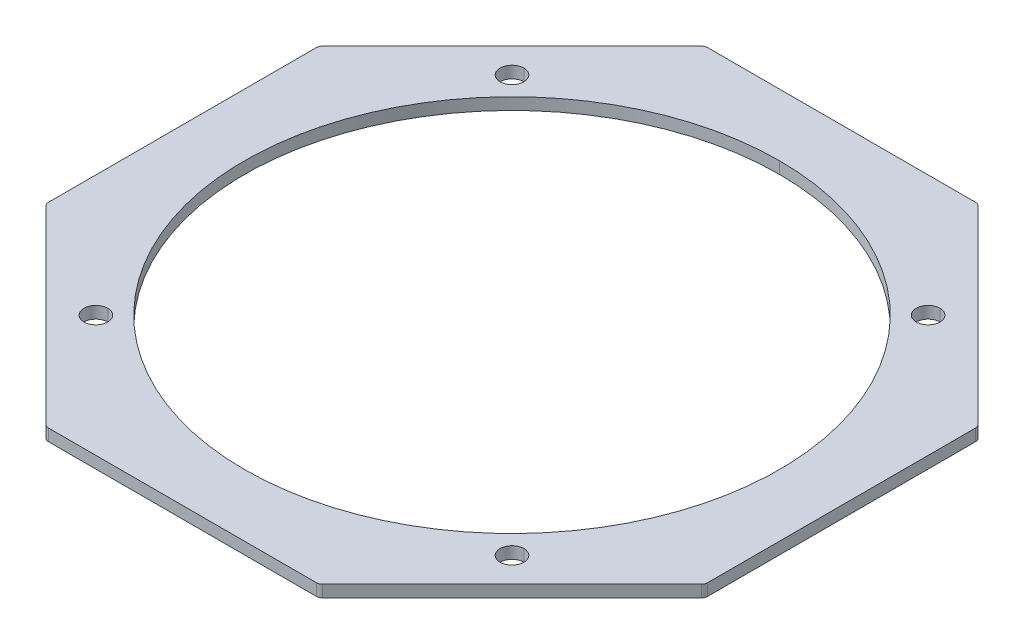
ISO-10303-21;
HEADER;
FILE_DESCRIPTION(('STEP AP214'),'2;1');
FILE_NAME('part.step','',(''),(''),'','','');
FILE_SCHEMA(('AUTOMOTIVE_DESIGN { 1 0 10303 214 1 1 1 1 }'));
ENDSEC;
DATA;
#1=APPLICATION_CONTEXT('core data for automotive mechanical design processes');
#2=APPLICATION_PROTOCOL_DEFINITION('international standard','automotive_design',2000,#1);
#3=PRODUCT_CONTEXT('',#1,'mechanical');
#4=PRODUCT('Part','Part','',(#3));
#5=PRODUCT_RELATED_PRODUCT_CATEGORY('part','',(#4));
#6=PRODUCT_DEFINITION_FORMATION('','',#4);
#7=PRODUCT_DEFINITION_CONTEXT('part definition',#1,'design');
#8=PRODUCT_DEFINITION('design','',#6,#7);
#9=PRODUCT_DEFINITION_SHAPE('','',#8);
#10=(LENGTH_UNIT() NAMED_UNIT(*) SI_UNIT(.MILLI.,.METRE.));
#11=(NAMED_UNIT(*) PLANE_ANGLE_UNIT() SI_UNIT($,.RADIAN.));
#12=(NAMED_UNIT(*) SI_UNIT($,.STERADIAN.) SOLID_ANGLE_UNIT());
#13=UNCERTAINTY_MEASURE_WITH_UNIT(LENGTH_MEASURE(1.E-05),#10,'distance_accuracy_value','');
#14=(GEOMETRIC_REPRESENTATION_CONTEXT(3) GLOBAL_UNCERTAINTY_ASSIGNED_CONTEXT((#13)) GLOBAL_UNIT_ASSIGNED_CONTEXT((#10,
#11,#12)) REPRESENTATION_CONTEXT('',''));
#15=CARTESIAN_POINT('',(0.,0.,0.));
#16=DIRECTION('',(0.,0.,1.));
#17=DIRECTION('',(1.,0.,0.));
#18=AXIS2_PLACEMENT_3D('',#15,#16,#17);
#19=CARTESIAN_POINT('',(213.9989878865,-2.,-119.7363133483));
#20=DIRECTION('',(0.,1.,0.));
#21=DIRECTION('',(0.,0.,1.));
#22=AXIS2_PLACEMENT_3D('',#19,#20,#21);
#23=CYLINDRICAL_SURFACE('',#22,2.);
#24=DIRECTION('',(0.,-1.,0.));
#25=VECTOR('',#24,1.);
#26=CARTESIAN_POINT('',(213.9989878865,0.,-121.7363133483));
#27=LINE('',#26,#25);
#28=CARTESIAN_POINT('',(213.9989878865,0.,-121.7363133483));
#29=VERTEX_POINT('',#28);
#30=CARTESIAN_POINT('',(213.9989878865,-2.,-121.7363133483));
#31=VERTEX_POINT('',#30);
#32=EDGE_CURVE('E10',#29,#31,#27,.T.);
#33=ORIENTED_EDGE('',*,*,#32,.F.);
#34=CARTESIAN_POINT('',(213.9989878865,0.,-119.7363133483));
#35=DIRECTION('',(0.,-1.,0.));
#36=DIRECTION('',(0.,0.,1.));
#37=AXIS2_PLACEMENT_3D('',#34,#35,#36);
#38=CIRCLE('',#37,2.);
#39=CARTESIAN_POINT('',(213.9989878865,0.,-117.7363133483));
#40=VERTEX_POINT('',#39);
#41=EDGE_CURVE('E469',#40,#29,#38,.T.);
#42=ORIENTED_EDGE('',*,*,#41,.F.);
#43=DIRECTION('',(0.,-1.,0.));
#44=VECTOR('',#43,1.);
#45=CARTESIAN_POINT('',(213.9989878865,0.,-117.7363133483));
#46=LINE('',#45,#44);
#47=CARTESIAN_POINT('',(213.9989878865,-2.,-117.7363133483));
#48=VERTEX_POINT('',#47);
#49=EDGE_CURVE('E26',#40,#48,#46,.T.);
#50=ORIENTED_EDGE('',*,*,#49,.T.);
#51=CARTESIAN_POINT('',(213.9989878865,-2.,-119.7363133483));
#52=DIRECTION('',(0.,1.,0.));
#53=DIRECTION('',(0.,0.,-1.));
#54=AXIS2_PLACEMENT_3D('',#51,#52,#53);
#55=CIRCLE('',#54,2.);
#56=EDGE_CURVE('E359',#31,#48,#55,.T.);
#57=ORIENTED_EDGE('',*,*,#56,.F.);
#58=EDGE_LOOP('',(#33,#42,#50,#57));
#59=FACE_BOUND('',#58,.T.);
#60=ADVANCED_FACE('F16',(#59),#23,.F.);
#61=CARTESIAN_POINT('',(213.9989878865,-2.,-119.7363133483));
#62=DIRECTION('',(0.,1.,0.));
#63=DIRECTION('',(0.,0.,1.));
#64=AXIS2_PLACEMENT_3D('',#61,#62,#63);
#65=CYLINDRICAL_SURFACE('',#64,2.);
#66=CARTESIAN_POINT('',(213.9989878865,-2.,-119.7363133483));
#67=DIRECTION('',(0.,1.,0.));
#68=DIRECTION('',(0.,0.,1.));
#69=AXIS2_PLACEMENT_3D('',#66,#67,#68);
#70=CIRCLE('',#69,2.);
#71=EDGE_CURVE('E387',#48,#31,#70,.T.);
#72=ORIENTED_EDGE('',*,*,#71,.F.);
#73=ORIENTED_EDGE('',*,*,#49,.F.);
#74=CARTESIAN_POINT('',(213.9989878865,0.,-119.7363133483));
#75=DIRECTION('',(0.,-1.,0.));
#76=DIRECTION('',(0.,0.,-1.));
#77=AXIS2_PLACEMENT_3D('',#74,#75,#76);
#78=CIRCLE('',#77,2.);
#79=EDGE_CURVE('E429',#29,#40,#78,.T.);
#80=ORIENTED_EDGE('',*,*,#79,.F.);
#81=ORIENTED_EDGE('',*,*,#32,.T.);
#82=EDGE_LOOP('',(#72,#73,#80,#81));
#83=FACE_BOUND('',#82,.T.);
#84=ADVANCED_FACE('F587',(#83),#65,.F.);
#85=CARTESIAN_POINT('',(283.9989878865,-2.,-189.7363133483));
#86=DIRECTION('',(0.,1.,0.));
#87=DIRECTION('',(0.,0.,1.));
#88=AXIS2_PLACEMENT_3D('',#85,#86,#87);
#89=CYLINDRICAL_SURFACE('',#88,2.);
#90=DIRECTION('',(0.,-1.,0.));
#91=VECTOR('',#90,1.);
#92=CARTESIAN_POINT('',(283.9989878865,0.,-191.7363133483));
#93=LINE('',#92,#91);
#94=CARTESIAN_POINT('',(283.9989878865,0.,-191.7363133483));
#95=VERTEX_POINT('',#94);
#96=CARTESIAN_POINT('',(283.9989878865,-2.,-191.7363133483));
#97=VERTEX_POINT('',#96);
#98=EDGE_CURVE('E304',#95,#97,#93,.T.);
#99=ORIENTED_EDGE('',*,*,#98,.F.);
#100=CARTESIAN_POINT('',(283.9989878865,0.,-189.7363133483));
#101=DIRECTION('',(0.,-1.,0.));
#102=DIRECTION('',(0.,0.,1.));
#103=AXIS2_PLACEMENT_3D('',#100,#101,#102);
#104=CIRCLE('',#103,2.);
#105=CARTESIAN_POINT('',(283.9989878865,0.,-187.7363133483));
#106=VERTEX_POINT('',#105);
#107=EDGE_CURVE('E353',#106,#95,#104,.T.);
#108=ORIENTED_EDGE('',*,*,#107,.F.);
#109=DIRECTION('',(0.,-1.,0.));
#110=VECTOR('',#109,1.);
#111=CARTESIAN_POINT('',(283.9989878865,0.,-187.7363133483));
#112=LINE('',#111,#110);
#113=CARTESIAN_POINT('',(283.9989878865,-2.,-187.7363133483));
#114=VERTEX_POINT('',#113);
#115=EDGE_CURVE('E307',#106,#114,#112,.T.);
#116=ORIENTED_EDGE('',*,*,#115,.T.);
#117=CARTESIAN_POINT('',(283.9989878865,-2.,-189.7363133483));
#118=DIRECTION('',(0.,1.,0.));
#119=DIRECTION('',(0.,0.,-1.));
#120=AXIS2_PLACEMENT_3D('',#117,#118,#119);
#121=CIRCLE('',#120,2.);
#122=EDGE_CURVE('E360',#97,#114,#121,.T.);
#123=ORIENTED_EDGE('',*,*,#122,.F.);
#124=EDGE_LOOP('',(#99,#108,#116,#123));
#125=FACE_BOUND('',#124,.T.);
#126=ADVANCED_FACE('F620',(#125),#89,.F.);
#127=CARTESIAN_POINT('',(283.9989878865,-2.,-189.7363133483));
#128=DIRECTION('',(0.,1.,0.));
#129=DIRECTION('',(0.,0.,1.));
#130=AXIS2_PLACEMENT_3D('',#127,#128,#129);
#131=CYLINDRICAL_SURFACE('',#130,2.);
#132=CARTESIAN_POINT('',(283.9989878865,-2.,-189.7363133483));
#133=DIRECTION('',(0.,1.,0.));
#134=DIRECTION('',(0.,0.,1.));
#135=AXIS2_PLACEMENT_3D('',#132,#133,#134);
#136=CIRCLE('',#135,2.);
#137=EDGE_CURVE('E355',#114,#97,#136,.T.);
#138=ORIENTED_EDGE('',*,*,#137,.F.);
#139=ORIENTED_EDGE('',*,*,#115,.F.);
#140=CARTESIAN_POINT('',(283.9989878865,0.,-189.7363133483));
#141=DIRECTION('',(0.,-1.,0.));
#142=DIRECTION('',(0.,0.,-1.));
#143=AXIS2_PLACEMENT_3D('',#140,#141,#142);
#144=CIRCLE('',#143,2.);
#145=EDGE_CURVE('E465',#95,#106,#144,.T.);
#146=ORIENTED_EDGE('',*,*,#145,.F.);
#147=ORIENTED_EDGE('',*,*,#98,.T.);
#148=EDGE_LOOP('',(#138,#139,#146,#147));
#149=FACE_BOUND('',#148,.T.);
#150=ADVANCED_FACE('F624',(#149),#131,.F.);
#151=CARTESIAN_POINT('',(248.9989878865,-2.,-154.7363133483));
#152=DIRECTION('',(0.,1.,0.));
#153=DIRECTION('',(0.,0.,1.));
#154=AXIS2_PLACEMENT_3D('',#151,#152,#153);
#155=CYLINDRICAL_SURFACE('',#154,45.);
#156=DIRECTION('',(0.,-1.,0.));
#157=VECTOR('',#156,1.);
#158=CARTESIAN_POINT('',(248.9989878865,0.,-199.7363133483));
#159=LINE('',#158,#157);
#160=CARTESIAN_POINT('',(248.9989878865,0.,-199.7363133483));
#161=VERTEX_POINT('',#160);
#162=CARTESIAN_POINT('',(248.9989878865,-2.,-199.7363133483));
#163=VERTEX_POINT('',#162);
#164=EDGE_CURVE('E394',#161,#163,#159,.T.);
#165=ORIENTED_EDGE('',*,*,#164,.F.);
#166=CARTESIAN_POINT('',(248.9989878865,0.,-154.7363133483));
#167=DIRECTION('',(0.,-1.,0.));
#168=DIRECTION('',(0.,0.,1.));
#169=AXIS2_PLACEMENT_3D('',#166,#167,#168);
#170=CIRCLE('',#169,45.);
#171=CARTESIAN_POINT('',(248.9989878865,0.,-109.7363133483));
#172=VERTEX_POINT('',#171);
#173=EDGE_CURVE('E354',#172,#161,#170,.T.);
#174=ORIENTED_EDGE('',*,*,#173,.F.);
#175=DIRECTION('',(0.,-1.,0.));
#176=VECTOR('',#175,1.);
#177=CARTESIAN_POINT('',(248.9989878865,0.,-109.7363133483));
#178=LINE('',#177,#176);
#179=CARTESIAN_POINT('',(248.9989878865,-2.,-109.7363133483));
#180=VERTEX_POINT('',#179);
#181=EDGE_CURVE('E397',#172,#180,#178,.T.);
#182=ORIENTED_EDGE('',*,*,#181,.T.);
#183=CARTESIAN_POINT('',(248.9989878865,-2.,-154.7363133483));
#184=DIRECTION('',(0.,1.,0.));
#185=DIRECTION('',(0.,0.,-1.));
#186=AXIS2_PLACEMENT_3D('',#183,#184,#185);
#187=CIRCLE('',#186,45.);
#188=EDGE_CURVE('E484',#163,#180,#187,.T.);
#189=ORIENTED_EDGE('',*,*,#188,.F.);
#190=EDGE_LOOP('',(#165,#174,#182,#189));
#191=FACE_BOUND('',#190,.T.);
#192=ADVANCED_FACE('F730',(#191),#155,.F.);
#193=CARTESIAN_POINT('',(248.9989878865,-2.,-154.7363133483));
#194=DIRECTION('',(0.,1.,0.));
#195=DIRECTION('',(0.,0.,1.));
#196=AXIS2_PLACEMENT_3D('',#193,#194,#195);
#197=CYLINDRICAL_SURFACE('',#196,45.);
#198=CARTESIAN_POINT('',(248.9989878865,-2.,-154.7363133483));
#199=DIRECTION('',(0.,1.,0.));
#200=DIRECTION('',(0.,0.,1.));
#201=AXIS2_PLACEMENT_3D('',#198,#199,#200);
#202=CIRCLE('',#201,45.);
#203=EDGE_CURVE('E19',#180,#163,#202,.T.);
#204=ORIENTED_EDGE('',*,*,#203,.F.);
#205=ORIENTED_EDGE('',*,*,#181,.F.);
#206=CARTESIAN_POINT('',(248.9989878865,0.,-154.7363133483));
#207=DIRECTION('',(0.,-1.,0.));
#208=DIRECTION('',(0.,0.,-1.));
#209=AXIS2_PLACEMENT_3D('',#206,#207,#208);
#210=CIRCLE('',#209,45.);
#211=EDGE_CURVE('E349',#161,#172,#210,.T.);
#212=ORIENTED_EDGE('',*,*,#211,.F.);
#213=ORIENTED_EDGE('',*,*,#164,.T.);
#214=EDGE_LOOP('',(#204,#205,#212,#213));
#215=FACE_BOUND('',#214,.T.);
#216=ADVANCED_FACE('F658',(#215),#197,.F.);
#217=CARTESIAN_POINT('',(213.9989878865,-2.,-189.7363133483));
#218=DIRECTION('',(0.,1.,0.));
#219=DIRECTION('',(0.,0.,1.));
#220=AXIS2_PLACEMENT_3D('',#217,#218,#219);
#221=CYLINDRICAL_SURFACE('',#220,2.);
#222=DIRECTION('',(0.,-1.,0.));
#223=VECTOR('',#222,1.);
#224=CARTESIAN_POINT('',(213.9989878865,0.,-191.7363133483));
#225=LINE('',#224,#223);
#226=CARTESIAN_POINT('',(213.9989878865,0.,-191.7363133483));
#227=VERTEX_POINT('',#226);
#228=CARTESIAN_POINT('',(213.9989878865,-2.,-191.7363133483));
#229=VERTEX_POINT('',#228);
#230=EDGE_CURVE('E137',#227,#229,#225,.T.);
#231=ORIENTED_EDGE('',*,*,#230,.F.);
#232=CARTESIAN_POINT('',(213.9989878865,0.,-189.7363133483));
#233=DIRECTION('',(0.,-1.,0.));
#234=DIRECTION('',(0.,0.,1.));
#235=AXIS2_PLACEMENT_3D('',#232,#233,#234);
#236=CIRCLE('',#235,2.);
#237=CARTESIAN_POINT('',(213.9989878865,0.,-187.7363133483));
#238=VERTEX_POINT('',#237);
#239=EDGE_CURVE('E374',#238,#227,#236,.T.);
#240=ORIENTED_EDGE('',*,*,#239,.F.);
#241=DIRECTION('',(0.,-1.,0.));
#242=VECTOR('',#241,1.);
#243=CARTESIAN_POINT('',(213.9989878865,0.,-187.7363133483));
#244=LINE('',#243,#242);
#245=CARTESIAN_POINT('',(213.9989878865,-2.,-187.7363133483));
#246=VERTEX_POINT('',#245);
#247=EDGE_CURVE('E123',#238,#246,#244,.T.);
#248=ORIENTED_EDGE('',*,*,#247,.T.);
#249=CARTESIAN_POINT('',(213.9989878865,-2.,-189.7363133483));
#250=DIRECTION('',(0.,1.,0.));
#251=DIRECTION('',(0.,0.,-1.));
#252=AXIS2_PLACEMENT_3D('',#249,#250,#251);
#253=CIRCLE('',#252,2.);
#254=EDGE_CURVE('E371',#229,#246,#253,.T.);
#255=ORIENTED_EDGE('',*,*,#254,.F.);
#256=EDGE_LOOP('',(#231,#240,#248,#255));
#257=FACE_BOUND('',#256,.T.);
#258=ADVANCED_FACE('F598',(#257),#221,.F.);
#259=CARTESIAN_POINT('',(213.9989878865,-2.,-189.7363133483));
#260=DIRECTION('',(0.,1.,0.));
#261=DIRECTION('',(0.,0.,1.));
#262=AXIS2_PLACEMENT_3D('',#259,#260,#261);
#263=CYLINDRICAL_SURFACE('',#262,2.);
#264=CARTESIAN_POINT('',(213.9989878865,-2.,-189.7363133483));
#265=DIRECTION('',(0.,1.,0.));
#266=DIRECTION('',(0.,0.,1.));
#267=AXIS2_PLACEMENT_3D('',#264,#265,#266);
#268=CIRCLE('',#267,2.);
#269=EDGE_CURVE('E401',#246,#229,#268,.T.);
#270=ORIENTED_EDGE('',*,*,#269,.F.);
#271=ORIENTED_EDGE('',*,*,#247,.F.);
#272=CARTESIAN_POINT('',(213.9989878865,0.,-189.7363133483));
#273=DIRECTION('',(0.,-1.,0.));
#274=DIRECTION('',(0.,0.,-1.));
#275=AXIS2_PLACEMENT_3D('',#272,#273,#274);
#276=CIRCLE('',#275,2.);
#277=EDGE_CURVE('E380',#227,#238,#276,.T.);
#278=ORIENTED_EDGE('',*,*,#277,.F.);
#279=ORIENTED_EDGE('',*,*,#230,.T.);
#280=EDGE_LOOP('',(#270,#271,#278,#279));
#281=FACE_BOUND('',#280,.T.);
#282=ADVANCED_FACE('F599',(#281),#263,.F.);
#283=CARTESIAN_POINT('',(283.9989878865,-2.,-119.7363133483));
#284=DIRECTION('',(0.,1.,0.));
#285=DIRECTION('',(0.,0.,1.));
#286=AXIS2_PLACEMENT_3D('',#283,#284,#285);
#287=CYLINDRICAL_SURFACE('',#286,2.);
#288=DIRECTION('',(0.,-1.,0.));
#289=VECTOR('',#288,1.);
#290=CARTESIAN_POINT('',(283.9989878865,0.,-121.7363133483));
#291=LINE('',#290,#289);
#292=CARTESIAN_POINT('',(283.9989878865,0.,-121.7363133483));
#293=VERTEX_POINT('',#292);
#294=CARTESIAN_POINT('',(283.9989878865,-2.,-121.7363133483));
#295=VERTEX_POINT('',#294);
#296=EDGE_CURVE('E193',#293,#295,#291,.T.);
#297=ORIENTED_EDGE('',*,*,#296,.F.);
#298=CARTESIAN_POINT('',(283.9989878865,0.,-119.7363133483));
#299=DIRECTION('',(0.,-1.,0.));
#300=DIRECTION('',(0.,0.,1.));
#301=AXIS2_PLACEMENT_3D('',#298,#299,#300);
#302=CIRCLE('',#301,2.);
#303=CARTESIAN_POINT('',(283.9989878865,0.,-117.7363133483));
#304=VERTEX_POINT('',#303);
#305=EDGE_CURVE('E334',#304,#293,#302,.T.);
#306=ORIENTED_EDGE('',*,*,#305,.F.);
#307=DIRECTION('',(0.,-1.,0.));
#308=VECTOR('',#307,1.);
#309=CARTESIAN_POINT('',(283.9989878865,0.,-117.7363133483));
#310=LINE('',#309,#308);
#311=CARTESIAN_POINT('',(283.9989878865,-2.,-117.7363133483));
#312=VERTEX_POINT('',#311);
#313=EDGE_CURVE('E206',#304,#312,#310,.T.);
#314=ORIENTED_EDGE('',*,*,#313,.T.);
#315=CARTESIAN_POINT('',(283.9989878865,-2.,-119.7363133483));
#316=DIRECTION('',(0.,1.,0.));
#317=DIRECTION('',(0.,0.,-1.));
#318=AXIS2_PLACEMENT_3D('',#315,#316,#317);
#319=CIRCLE('',#318,2.);
#320=EDGE_CURVE('E314',#295,#312,#319,.T.);
#321=ORIENTED_EDGE('',*,*,#320,.F.);
#322=EDGE_LOOP('',(#297,#306,#314,#321));
#323=FACE_BOUND('',#322,.T.);
#324=ADVANCED_FACE('F510',(#323),#287,.F.);
#325=CARTESIAN_POINT('',(283.9989878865,-2.,-119.7363133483));
#326=DIRECTION('',(0.,1.,0.));
#327=DIRECTION('',(0.,0.,1.));
#328=AXIS2_PLACEMENT_3D('',#325,#326,#327);
#329=CYLINDRICAL_SURFACE('',#328,2.);
#330=CARTESIAN_POINT('',(283.9989878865,-2.,-119.7363133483));
#331=DIRECTION('',(0.,1.,0.));
#332=DIRECTION('',(0.,0.,1.));
#333=AXIS2_PLACEMENT_3D('',#330,#331,#332);
#334=CIRCLE('',#333,2.);
#335=EDGE_CURVE('E367',#312,#295,#334,.T.);
#336=ORIENTED_EDGE('',*,*,#335,.F.);
#337=ORIENTED_EDGE('',*,*,#313,.F.);
#338=CARTESIAN_POINT('',(283.9989878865,0.,-119.7363133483));
#339=DIRECTION('',(0.,-1.,0.));
#340=DIRECTION('',(0.,0.,-1.));
#341=AXIS2_PLACEMENT_3D('',#338,#339,#340);
#342=CIRCLE('',#341,2.);
#343=EDGE_CURVE('E338',#293,#304,#342,.T.);
#344=ORIENTED_EDGE('',*,*,#343,.F.);
#345=ORIENTED_EDGE('',*,*,#296,.T.);
#346=EDGE_LOOP('',(#336,#337,#344,#345));
#347=FACE_BOUND('',#346,.T.);
#348=ADVANCED_FACE('F511',(#347),#329,.F.);
#349=CARTESIAN_POINT('',(226.4521955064,-2.,-99.30354139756));
#350=DIRECTION('',(1.261796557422E-13,0.,1.));
#351=DIRECTION('',(1.,0.,-1.261796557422E-13));
#352=AXIS2_PLACEMENT_3D('',#349,#350,#351);
#353=PLANE('',#352);
#354=DIRECTION('',(0.,1.,0.));
#355=VECTOR('',#354,1.);
#356=CARTESIAN_POINT('',(226.4521955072,-2.,-99.30354139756));
#357=LINE('',#356,#355);
#358=CARTESIAN_POINT('',(226.4521955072,-2.,-99.30354139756));
#359=VERTEX_POINT('',#358);
#360=CARTESIAN_POINT('',(226.4521955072,0.,-99.30354139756));
#361=VERTEX_POINT('',#360);
#362=EDGE_CURVE('E391',#359,#361,#357,.T.);
#363=ORIENTED_EDGE('',*,*,#362,.F.);
#364=DIRECTION('',(-1.,0.,0.));
#365=VECTOR('',#364,1.);
#366=CARTESIAN_POINT('',(271.5457802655,-2.,-99.30354139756));
#367=LINE('',#366,#365);
#368=CARTESIAN_POINT('',(271.545780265,-2.,-99.30354139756));
#369=VERTEX_POINT('',#368);
#370=EDGE_CURVE('E443',#369,#359,#367,.T.);
#371=ORIENTED_EDGE('',*,*,#370,.F.);
#372=DIRECTION('',(0.,-1.,0.));
#373=VECTOR('',#372,1.);
#374=CARTESIAN_POINT('',(271.5457802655,0.,-99.30354139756));
#375=LINE('',#374,#373);
#376=CARTESIAN_POINT('',(271.5457802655,0.,-99.30354139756));
#377=VERTEX_POINT('',#376);
#378=EDGE_CURVE('E425',#377,#369,#375,.T.);
#379=ORIENTED_EDGE('',*,*,#378,.F.);
#380=DIRECTION('',(-1.,0.,0.));
#381=VECTOR('',#380,1.);
#382=CARTESIAN_POINT('',(271.5457802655,0.,-99.30354139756));
#383=LINE('',#382,#381);
#384=EDGE_CURVE('E328',#377,#361,#383,.T.);
#385=ORIENTED_EDGE('',*,*,#384,.T.);
#386=EDGE_LOOP('',(#363,#371,#379,#385));
#387=FACE_BOUND('',#386,.T.);
#388=ADVANCED_FACE('F554',(#387),#353,.T.);
#389=CARTESIAN_POINT('',(226.4521955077,-2.,-100.3035413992));
#390=DIRECTION('',(0.,1.,0.));
#391=DIRECTION('',(0.,0.,1.));
#392=AXIS2_PLACEMENT_3D('',#389,#390,#391);
#393=CYLINDRICAL_SURFACE('',#392,1.000000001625);
#394=DIRECTION('',(0.,-1.,0.));
#395=VECTOR('',#394,1.);
#396=CARTESIAN_POINT('',(225.7450887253,0.,-99.59643461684));
#397=LINE('',#396,#395);
#398=CARTESIAN_POINT('',(225.7450887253,0.,-99.59643461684));
#399=VERTEX_POINT('',#398);
#400=CARTESIAN_POINT('',(225.7450887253,-2.,-99.59643461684));
#401=VERTEX_POINT('',#400);
#402=EDGE_CURVE('E302',#399,#401,#397,.T.);
#403=ORIENTED_EDGE('',*,*,#402,.T.);
#404=CARTESIAN_POINT('',(226.4521955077,-2.,-100.3035413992));
#405=DIRECTION('',(0.,-1.,0.));
#406=DIRECTION('',(-2.1600499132E-11,0.,1.));
#407=AXIS2_PLACEMENT_3D('',#404,#405,#406);
#408=CIRCLE('',#407,1.000000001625);
#409=EDGE_CURVE('E406',#359,#401,#408,.T.);
#410=ORIENTED_EDGE('',*,*,#409,.F.);
#411=ORIENTED_EDGE('',*,*,#362,.T.);
#412=CARTESIAN_POINT('',(226.4521955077,0.,-100.3035413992));
#413=DIRECTION('',(0.,1.,0.));
#414=DIRECTION('',(-0.707106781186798,0.,0.707106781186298));
#415=AXIS2_PLACEMENT_3D('',#412,#413,#414);
#416=CIRCLE('',#415,1.000000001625);
#417=EDGE_CURVE('E333',#399,#361,#416,.T.);
#418=ORIENTED_EDGE('',*,*,#417,.F.);
#419=EDGE_LOOP('',(#403,#410,#411,#418));
#420=FACE_BOUND('',#419,.T.);
#421=ADVANCED_FACE('F648',(#420),#393,.T.);
#422=CARTESIAN_POINT('',(193.8591091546,-2.,-131.4824141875));
#423=DIRECTION('',(-0.707106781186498,0.,0.707106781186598));
#424=DIRECTION('',(0.,1.,0.));
#425=AXIS2_PLACEMENT_3D('',#422,#423,#424);
#426=PLANE('',#425);
#427=DIRECTION('',(0.,1.,0.));
#428=VECTOR('',#427,1.);
#429=CARTESIAN_POINT('',(193.8591091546,-2.,-131.4824141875));
#430=LINE('',#429,#428);
#431=CARTESIAN_POINT('',(193.8591091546,-2.,-131.4824141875));
#432=VERTEX_POINT('',#431);
#433=CARTESIAN_POINT('',(193.8591091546,0.,-131.4824141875));
#434=VERTEX_POINT('',#433);
#435=EDGE_CURVE('E299',#432,#434,#430,.T.);
#436=ORIENTED_EDGE('',*,*,#435,.F.);
#437=DIRECTION('',(-0.707106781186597,0.,-0.707106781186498));
#438=VECTOR('',#437,1.);
#439=CARTESIAN_POINT('',(225.7450887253,-2.,-99.59643461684));
#440=LINE('',#439,#438);
#441=EDGE_CURVE('E402',#401,#432,#440,.T.);
#442=ORIENTED_EDGE('',*,*,#441,.F.);
#443=ORIENTED_EDGE('',*,*,#402,.F.);
#444=DIRECTION('',(0.707106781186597,0.,0.707106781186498));
#445=VECTOR('',#444,1.);
#446=CARTESIAN_POINT('',(193.8591091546,0.,-131.4824141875));
#447=LINE('',#446,#445);
#448=EDGE_CURVE('E439',#434,#399,#447,.T.);
#449=ORIENTED_EDGE('',*,*,#448,.F.);
#450=EDGE_LOOP('',(#436,#442,#443,#449));
#451=FACE_BOUND('',#450,.T.);
#452=ADVANCED_FACE('F640',(#451),#426,.T.);
#453=CARTESIAN_POINT('',(194.5662159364,-2.,-132.1895209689));
#454=DIRECTION('',(0.,1.,0.));
#455=DIRECTION('',(0.,0.,1.));
#456=AXIS2_PLACEMENT_3D('',#453,#454,#455);
#457=CYLINDRICAL_SURFACE('',#456,1.000000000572);
#458=DIRECTION('',(0.,-1.,0.));
#459=VECTOR('',#458,1.);
#460=CARTESIAN_POINT('',(193.5662159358,0.,-132.1895209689));
#461=LINE('',#460,#459);
#462=CARTESIAN_POINT('',(193.5662159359,0.,-132.1895209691));
#463=VERTEX_POINT('',#462);
#464=CARTESIAN_POINT('',(193.5662159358,-2.,-132.1895209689));
#465=VERTEX_POINT('',#464);
#466=EDGE_CURVE('E303',#463,#465,#461,.T.);
#467=ORIENTED_EDGE('',*,*,#466,.T.);
#468=CARTESIAN_POINT('',(194.5662159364,-2.,-132.1895209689));
#469=DIRECTION('',(0.,-1.,0.));
#470=DIRECTION('',(-0.707106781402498,0.,0.707106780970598));
#471=AXIS2_PLACEMENT_3D('',#468,#469,#470);
#472=CIRCLE('',#471,1.000000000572);
#473=EDGE_CURVE('E364',#432,#465,#472,.T.);
#474=ORIENTED_EDGE('',*,*,#473,.F.);
#475=ORIENTED_EDGE('',*,*,#435,.T.);
#476=CARTESIAN_POINT('',(194.5662159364,0.,-132.1895209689));
#477=DIRECTION('',(0.,1.,0.));
#478=DIRECTION('',(-1.,0.,-2.033004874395E-10));
#479=AXIS2_PLACEMENT_3D('',#476,#477,#478);
#480=CIRCLE('',#479,1.000000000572);
#481=EDGE_CURVE('E435',#463,#434,#480,.T.);
#482=ORIENTED_EDGE('',*,*,#481,.F.);
#483=EDGE_LOOP('',(#467,#474,#475,#482));
#484=FACE_BOUND('',#483,.T.);
#485=ADVANCED_FACE('F637',(#484),#457,.T.);
#486=CARTESIAN_POINT('',(193.5662159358,-2.,-177.2831057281));
#487=DIRECTION('',(-1.,0.,1.958554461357E-12));
#488=DIRECTION('',(0.,1.,0.));
#489=AXIS2_PLACEMENT_3D('',#486,#487,#488);
#490=PLANE('',#489);
#491=DIRECTION('',(0.,1.,0.));
#492=VECTOR('',#491,1.);
#493=CARTESIAN_POINT('',(193.5662159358,-2.,-177.2831057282));
#494=LINE('',#493,#492);
#495=CARTESIAN_POINT('',(193.5662159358,-2.,-177.2831057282));
#496=VERTEX_POINT('',#495);
#497=CARTESIAN_POINT('',(193.5662159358,0.,-177.2831057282));
#498=VERTEX_POINT('',#497);
#499=EDGE_CURVE('E388',#496,#498,#494,.T.);
#500=ORIENTED_EDGE('',*,*,#499,.F.);
#501=DIRECTION('',(-1.305945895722E-12,0.,-1.));
#502=VECTOR('',#501,1.);
#503=CARTESIAN_POINT('',(193.5662159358,-2.,-132.1895209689));
#504=LINE('',#503,#502);
#505=EDGE_CURVE('E315',#465,#496,#504,.T.);
#506=ORIENTED_EDGE('',*,*,#505,.F.);
#507=ORIENTED_EDGE('',*,*,#466,.F.);
#508=DIRECTION('',(-1.307206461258E-12,0.,-1.));
#509=VECTOR('',#508,1.);
#510=CARTESIAN_POINT('',(193.5662159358,0.,-132.1895209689));
#511=LINE('',#510,#509);
#512=EDGE_CURVE('E326',#463,#498,#511,.T.);
#513=ORIENTED_EDGE('',*,*,#512,.T.);
#514=EDGE_LOOP('',(#500,#506,#507,#513));
#515=FACE_BOUND('',#514,.T.);
#516=ADVANCED_FACE('F533',(#515),#490,.T.);
#517=CARTESIAN_POINT('',(194.5662159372,-2.,-177.2831057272));
#518=DIRECTION('',(0.,1.,0.));
#519=DIRECTION('',(0.,0.,1.));
#520=AXIS2_PLACEMENT_3D('',#517,#518,#519);
#521=CYLINDRICAL_SURFACE('',#520,1.000000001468);
#522=DIRECTION('',(0.,-1.,0.));
#523=VECTOR('',#522,1.);
#524=CARTESIAN_POINT('',(193.8591091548,0.,-177.9902125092));
#525=LINE('',#524,#523);
#526=CARTESIAN_POINT('',(193.8591091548,0.,-177.9902125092));
#527=VERTEX_POINT('',#526);
#528=CARTESIAN_POINT('',(193.8591091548,-2.,-177.9902125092));
#529=VERTEX_POINT('',#528);
#530=EDGE_CURVE('E320',#527,#529,#525,.T.);
#531=ORIENTED_EDGE('',*,*,#530,.T.);
#532=CARTESIAN_POINT('',(194.5662159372,-2.,-177.2831057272));
#533=DIRECTION('',(0.,-1.,0.));
#534=DIRECTION('',(-1.,0.,-1.27016619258E-09));
#535=AXIS2_PLACEMENT_3D('',#532,#533,#534);
#536=CIRCLE('',#535,1.000000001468);
#537=EDGE_CURVE('E310',#496,#529,#536,.T.);
#538=ORIENTED_EDGE('',*,*,#537,.F.);
#539=ORIENTED_EDGE('',*,*,#499,.T.);
#540=CARTESIAN_POINT('',(194.5662159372,0.,-177.2831057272));
#541=DIRECTION('',(0.,1.,0.));
#542=DIRECTION('',(-0.707106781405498,0.,-0.707106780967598));
#543=AXIS2_PLACEMENT_3D('',#540,#541,#542);
#544=CIRCLE('',#543,1.000000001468);
#545=EDGE_CURVE('E322',#527,#498,#544,.T.);
#546=ORIENTED_EDGE('',*,*,#545,.F.);
#547=EDGE_LOOP('',(#531,#538,#539,#546));
#548=FACE_BOUND('',#547,.T.);
#549=ADVANCED_FACE('F540',(#548),#521,.T.);
#550=CARTESIAN_POINT('',(271.5457802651,-2.,-100.3035413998));
#551=DIRECTION('',(0.,1.,0.));
#552=DIRECTION('',(1.,0.,0.));
#553=AXIS2_PLACEMENT_3D('',#550,#551,#552);
#554=PLANE('',#553);
#555=ORIENTED_EDGE('',*,*,#56,.T.);
#556=ORIENTED_EDGE('',*,*,#71,.T.);
#557=EDGE_LOOP('',(#555,#556));
#558=FACE_BOUND('',#557,.T.);
#559=ORIENTED_EDGE('',*,*,#122,.T.);
#560=ORIENTED_EDGE('',*,*,#137,.T.);
#561=EDGE_LOOP('',(#559,#560));
#562=FACE_BOUND('',#561,.T.);
#563=ORIENTED_EDGE('',*,*,#188,.T.);
#564=ORIENTED_EDGE('',*,*,#203,.T.);
#565=EDGE_LOOP('',(#563,#564));
#566=FACE_BOUND('',#565,.T.);
#567=ORIENTED_EDGE('',*,*,#254,.T.);
#568=ORIENTED_EDGE('',*,*,#269,.T.);
#569=EDGE_LOOP('',(#567,#568));
#570=FACE_BOUND('',#569,.T.);
#571=ORIENTED_EDGE('',*,*,#320,.T.);
#572=ORIENTED_EDGE('',*,*,#335,.T.);
#573=EDGE_LOOP('',(#571,#572));
#574=FACE_BOUND('',#573,.T.);
#575=ORIENTED_EDGE('',*,*,#370,.T.);
#576=ORIENTED_EDGE('',*,*,#409,.T.);
#577=ORIENTED_EDGE('',*,*,#441,.T.);
#578=ORIENTED_EDGE('',*,*,#473,.T.);
#579=ORIENTED_EDGE('',*,*,#505,.T.);
#580=ORIENTED_EDGE('',*,*,#537,.T.);
#581=DIRECTION('',(0.707106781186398,0.,-0.707106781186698));
#582=VECTOR('',#581,1.);
#583=CARTESIAN_POINT('',(193.8591091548,-2.,-177.9902125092));
#584=LINE('',#583,#582);
#585=CARTESIAN_POINT('',(225.7450887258,-2.,-209.8761920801));
#586=VERTEX_POINT('',#585);
#587=EDGE_CURVE('E316',#529,#586,#584,.T.);
#588=ORIENTED_EDGE('',*,*,#587,.T.);
#589=CARTESIAN_POINT('',(226.4521955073,-2.,-209.1690852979));
#590=DIRECTION('',(0.,-1.,0.));
#591=DIRECTION('',(-0.707106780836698,0.,-0.707106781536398));
#592=AXIS2_PLACEMENT_3D('',#589,#590,#591);
#593=CIRCLE('',#592,1.000000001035);
#594=CARTESIAN_POINT('',(226.4521955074,-2.,-210.1690852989));
#595=VERTEX_POINT('',#594);
#596=EDGE_CURVE('E347',#586,#595,#593,.T.);
#597=ORIENTED_EDGE('',*,*,#596,.T.);
#598=DIRECTION('',(1.,0.,-1.154678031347E-12));
#599=VECTOR('',#598,1.);
#600=CARTESIAN_POINT('',(226.4521955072,-2.,-210.1690852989));
#601=LINE('',#600,#599);
#602=CARTESIAN_POINT('',(271.5457802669,-2.,-210.169085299));
#603=VERTEX_POINT('',#602);
#604=EDGE_CURVE('E348',#595,#603,#601,.T.);
#605=ORIENTED_EDGE('',*,*,#604,.T.);
#606=CARTESIAN_POINT('',(271.5457802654,-2.,-209.1690852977));
#607=DIRECTION('',(0.,-1.,0.));
#608=DIRECTION('',(1.449393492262E-09,0.,-1.));
#609=AXIS2_PLACEMENT_3D('',#606,#607,#608);
#610=CIRCLE('',#609,1.000000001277);
#611=CARTESIAN_POINT('',(272.2528870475,-2.,-209.8761920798));
#612=VERTEX_POINT('',#611);
#613=EDGE_CURVE('E294',#603,#612,#610,.T.);
#614=ORIENTED_EDGE('',*,*,#613,.T.);
#615=DIRECTION('',(0.707106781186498,0.,0.707106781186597));
#616=VECTOR('',#615,1.);
#617=CARTESIAN_POINT('',(272.2528870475,-2.,-209.8761920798));
#618=LINE('',#617,#616);
#619=CARTESIAN_POINT('',(304.1388666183,-2.,-177.9902125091));
#620=VERTEX_POINT('',#619);
#621=EDGE_CURVE('E462',#612,#620,#618,.T.);
#622=ORIENTED_EDGE('',*,*,#621,.T.);
#623=CARTESIAN_POINT('',(303.4317598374,-2.,-177.2831057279));
#624=DIRECTION('',(0.,-1.,0.));
#625=DIRECTION('',(0.707106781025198,0.,-0.707106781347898));
#626=AXIS2_PLACEMENT_3D('',#623,#624,#625);
#627=CIRCLE('',#626,0.9999999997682);
#628=CARTESIAN_POINT('',(304.4317598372,-2.,-177.2831057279));
#629=VERTEX_POINT('',#628);
#630=EDGE_CURVE('E264',#620,#629,#627,.T.);
#631=ORIENTED_EDGE('',*,*,#630,.T.);
#632=DIRECTION('',(-1.386622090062E-13,0.,1.));
#633=VECTOR('',#632,1.);
#634=CARTESIAN_POINT('',(304.4317598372,-2.,-177.2831057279));
#635=LINE('',#634,#633);
#636=CARTESIAN_POINT('',(304.4317598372,-2.,-132.1895209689));
#637=VERTEX_POINT('',#636);
#638=EDGE_CURVE('E260',#629,#637,#635,.T.);
#639=ORIENTED_EDGE('',*,*,#638,.T.);
#640=CARTESIAN_POINT('',(303.4317598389,-2.,-132.189520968));
#641=DIRECTION('',(0.,-1.,0.));
#642=DIRECTION('',(1.,0.,-9.141842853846E-10));
#643=AXIS2_PLACEMENT_3D('',#640,#641,#642);
#644=CIRCLE('',#643,0.9999999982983);
#645=CARTESIAN_POINT('',(304.1388666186,-2.,-131.4824141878));
#646=VERTEX_POINT('',#645);
#647=EDGE_CURVE('E342',#637,#646,#644,.T.);
#648=ORIENTED_EDGE('',*,*,#647,.T.);
#649=DIRECTION('',(-0.707106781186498,0.,0.707106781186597));
#650=VECTOR('',#649,1.);
#651=CARTESIAN_POINT('',(304.1388666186,-2.,-131.4824141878));
#652=LINE('',#651,#650);
#653=CARTESIAN_POINT('',(272.2528870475,-2.,-99.5964346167));
#654=VERTEX_POINT('',#653);
#655=EDGE_CURVE('E379',#646,#654,#652,.T.);
#656=ORIENTED_EDGE('',*,*,#655,.T.);
#657=CARTESIAN_POINT('',(271.5457802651,-2.,-100.3035413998));
#658=DIRECTION('',(0.,-1.,0.));
#659=DIRECTION('',(0.707106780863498,0.,0.707106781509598));
#660=AXIS2_PLACEMENT_3D('',#657,#658,#659);
#661=CIRCLE('',#660,1.000000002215);
#662=EDGE_CURVE('E419',#654,#369,#661,.T.);
#663=ORIENTED_EDGE('',*,*,#662,.T.);
#664=EDGE_LOOP('',(#575,#576,#577,#578,#579,#580,#588,#597,#605,#614,#622,#631,#639,#648,#656,#663));
#665=FACE_BOUND('',#664,.T.);
#666=ADVANCED_FACE('F508',(#558,#562,#566,#570,#574,#665),#554,.F.);
#667=CARTESIAN_POINT('',(226.4521955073,-2.,-209.1690852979));
#668=DIRECTION('',(0.,1.,0.));
#669=DIRECTION('',(0.,0.,1.));
#670=AXIS2_PLACEMENT_3D('',#667,#668,#669);
#671=CYLINDRICAL_SURFACE('',#670,1.000000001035);
#672=DIRECTION('',(0.,-1.,0.));
#673=VECTOR('',#672,1.);
#674=CARTESIAN_POINT('',(226.4521955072,0.,-210.1690852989));
#675=LINE('',#674,#673);
#676=CARTESIAN_POINT('',(226.4521955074,0.,-210.1690852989));
#677=VERTEX_POINT('',#676);
#678=EDGE_CURVE('E343',#677,#595,#675,.T.);
#679=ORIENTED_EDGE('',*,*,#678,.T.);
#680=ORIENTED_EDGE('',*,*,#596,.F.);
#681=DIRECTION('',(0.,1.,0.));
#682=VECTOR('',#681,1.);
#683=CARTESIAN_POINT('',(225.7450887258,-2.,-209.8761920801));
#684=LINE('',#683,#682);
#685=CARTESIAN_POINT('',(225.7450887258,0.,-209.8761920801));
#686=VERTEX_POINT('',#685);
#687=EDGE_CURVE('E321',#586,#686,#684,.T.);
#688=ORIENTED_EDGE('',*,*,#687,.T.);
#689=CARTESIAN_POINT('',(226.4521955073,0.,-209.1690852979));
#690=DIRECTION('',(0.,1.,0.));
#691=DIRECTION('',(5.073275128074E-11,0.,-1.));
#692=AXIS2_PLACEMENT_3D('',#689,#690,#691);
#693=CIRCLE('',#692,1.000000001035);
#694=EDGE_CURVE('E327',#677,#686,#693,.T.);
#695=ORIENTED_EDGE('',*,*,#694,.F.);
#696=EDGE_LOOP('',(#679,#680,#688,#695));
#697=FACE_BOUND('',#696,.T.);
#698=ADVANCED_FACE('F591',(#697),#671,.T.);
#699=CARTESIAN_POINT('',(271.5457802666,-2.,-210.169085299));
#700=DIRECTION('',(-1.732046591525E-12,0.,-1.));
#701=DIRECTION('',(-1.,0.,1.732046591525E-12));
#702=AXIS2_PLACEMENT_3D('',#699,#700,#701);
#703=PLANE('',#702);
#704=DIRECTION('',(0.,1.,0.));
#705=VECTOR('',#704,1.);
#706=CARTESIAN_POINT('',(271.5457802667,-2.,-210.169085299));
#707=LINE('',#706,#705);
#708=CARTESIAN_POINT('',(271.5457802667,0.,-210.169085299));
#709=VERTEX_POINT('',#708);
#710=EDGE_CURVE('E297',#603,#709,#707,.T.);
#711=ORIENTED_EDGE('',*,*,#710,.F.);
#712=ORIENTED_EDGE('',*,*,#604,.F.);
#713=ORIENTED_EDGE('',*,*,#678,.F.);
#714=DIRECTION('',(1.,0.,-1.154047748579E-12));
#715=VECTOR('',#714,1.);
#716=CARTESIAN_POINT('',(226.4521955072,0.,-210.1690852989));
#717=LINE('',#716,#715);
#718=EDGE_CURVE('E293',#677,#709,#717,.T.);
#719=ORIENTED_EDGE('',*,*,#718,.T.);
#720=EDGE_LOOP('',(#711,#712,#713,#719));
#721=FACE_BOUND('',#720,.T.);
#722=ADVANCED_FACE('F641',(#721),#703,.T.);
#723=CARTESIAN_POINT('',(271.5457802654,-2.,-209.1690852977));
#724=DIRECTION('',(0.,1.,0.));
#725=DIRECTION('',(0.,0.,1.));
#726=AXIS2_PLACEMENT_3D('',#723,#724,#725);
#727=CYLINDRICAL_SURFACE('',#726,1.000000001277);
#728=DIRECTION('',(0.,-1.,0.));
#729=VECTOR('',#728,1.);
#730=CARTESIAN_POINT('',(272.2528870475,0.,-209.8761920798));
#731=LINE('',#730,#729);
#732=CARTESIAN_POINT('',(272.2528870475,0.,-209.8761920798));
#733=VERTEX_POINT('',#732);
#734=EDGE_CURVE('E298',#733,#612,#731,.T.);
#735=ORIENTED_EDGE('',*,*,#734,.T.);
#736=ORIENTED_EDGE('',*,*,#613,.F.);
#737=ORIENTED_EDGE('',*,*,#710,.T.);
#738=CARTESIAN_POINT('',(271.5457802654,0.,-209.1690852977));
#739=DIRECTION('',(0.,1.,0.));
#740=DIRECTION('',(0.707106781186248,0.,-0.707106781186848));
#741=AXIS2_PLACEMENT_3D('',#738,#739,#740);
#742=CIRCLE('',#741,1.000000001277);
#743=EDGE_CURVE('E290',#733,#709,#742,.T.);
#744=ORIENTED_EDGE('',*,*,#743,.F.);
#745=EDGE_LOOP('',(#735,#736,#737,#744));
#746=FACE_BOUND('',#745,.T.);
#747=ADVANCED_FACE('F644',(#746),#727,.T.);
#748=CARTESIAN_POINT('',(304.1388666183,-2.,-177.9902125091));
#749=DIRECTION('',(0.707106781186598,0.,-0.707106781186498));
#750=DIRECTION('',(0.,-1.,0.));
#751=AXIS2_PLACEMENT_3D('',#748,#749,#750);
#752=PLANE('',#751);
#753=DIRECTION('',(0.,1.,0.));
#754=VECTOR('',#753,1.);
#755=CARTESIAN_POINT('',(304.1388666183,-2.,-177.9902125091));
#756=LINE('',#755,#754);
#757=CARTESIAN_POINT('',(304.1388666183,0.,-177.9902125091));
#758=VERTEX_POINT('',#757);
#759=EDGE_CURVE('E270',#620,#758,#756,.T.);
#760=ORIENTED_EDGE('',*,*,#759,.F.);
#761=ORIENTED_EDGE('',*,*,#621,.F.);
#762=ORIENTED_EDGE('',*,*,#734,.F.);
#763=DIRECTION('',(-0.707106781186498,0.,-0.707106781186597));
#764=VECTOR('',#763,1.);
#765=CARTESIAN_POINT('',(304.1388666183,0.,-177.9902125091));
#766=LINE('',#765,#764);
#767=EDGE_CURVE('E275',#758,#733,#766,.T.);
#768=ORIENTED_EDGE('',*,*,#767,.F.);
#769=EDGE_LOOP('',(#760,#761,#762,#768));
#770=FACE_BOUND('',#769,.T.);
#771=ADVANCED_FACE('F651',(#770),#752,.T.);
#772=CARTESIAN_POINT('',(303.4317598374,-2.,-177.2831057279));
#773=DIRECTION('',(0.,1.,0.));
#774=DIRECTION('',(0.,0.,1.));
#775=AXIS2_PLACEMENT_3D('',#772,#773,#774);
#776=CYLINDRICAL_SURFACE('',#775,0.9999999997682);
#777=DIRECTION('',(0.,-1.,0.));
#778=VECTOR('',#777,1.);
#779=CARTESIAN_POINT('',(304.4317598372,0.,-177.2831057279));
#780=LINE('',#779,#778);
#781=CARTESIAN_POINT('',(304.4317598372,0.,-177.2831057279));
#782=VERTEX_POINT('',#781);
#783=EDGE_CURVE('E253',#782,#629,#780,.T.);
#784=ORIENTED_EDGE('',*,*,#783,.T.);
#785=ORIENTED_EDGE('',*,*,#630,.F.);
#786=ORIENTED_EDGE('',*,*,#759,.T.);
#787=CARTESIAN_POINT('',(303.4317598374,0.,-177.2831057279));
#788=DIRECTION('',(0.,1.,0.));
#789=DIRECTION('',(1.,0.,-3.575451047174E-11));
#790=AXIS2_PLACEMENT_3D('',#787,#788,#789);
#791=CIRCLE('',#790,0.9999999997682);
#792=EDGE_CURVE('E267',#782,#758,#791,.T.);
#793=ORIENTED_EDGE('',*,*,#792,.F.);
#794=EDGE_LOOP('',(#784,#785,#786,#793));
#795=FACE_BOUND('',#794,.T.);
#796=ADVANCED_FACE('F268',(#795),#776,.T.);
#797=CARTESIAN_POINT('',(304.4317598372,-2.,-132.1895209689));
#798=DIRECTION('',(1.,0.,2.092735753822E-13));
#799=DIRECTION('',(-2.092735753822E-13,0.,1.));
#800=AXIS2_PLACEMENT_3D('',#797,#798,#799);
#801=PLANE('',#800);
#802=DIRECTION('',(0.,1.,0.));
#803=VECTOR('',#802,1.);
#804=CARTESIAN_POINT('',(304.4317598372,-2.,-132.1895209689));
#805=LINE('',#804,#803);
#806=CARTESIAN_POINT('',(304.4317598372,0.,-132.1895209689));
#807=VERTEX_POINT('',#806);
#808=EDGE_CURVE('E339',#637,#807,#805,.T.);
#809=ORIENTED_EDGE('',*,*,#808,.F.);
#810=ORIENTED_EDGE('',*,*,#638,.F.);
#811=ORIENTED_EDGE('',*,*,#783,.F.);
#812=DIRECTION('',(-1.386622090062E-13,0.,1.));
#813=VECTOR('',#812,1.);
#814=CARTESIAN_POINT('',(304.4317598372,0.,-177.2831057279));
#815=LINE('',#814,#813);
#816=EDGE_CURVE('E258',#782,#807,#815,.T.);
#817=ORIENTED_EDGE('',*,*,#816,.T.);
#818=EDGE_LOOP('',(#809,#810,#811,#817));
#819=FACE_BOUND('',#818,.T.);
#820=ADVANCED_FACE('F256',(#819),#801,.T.);
#821=CARTESIAN_POINT('',(303.4317598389,-2.,-132.189520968));
#822=DIRECTION('',(0.,1.,0.));
#823=DIRECTION('',(0.,0.,1.));
#824=AXIS2_PLACEMENT_3D('',#821,#822,#823);
#825=CYLINDRICAL_SURFACE('',#824,0.9999999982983);
#826=DIRECTION('',(0.,-1.,0.));
#827=VECTOR('',#826,1.);
#828=CARTESIAN_POINT('',(304.1388666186,0.,-131.4824141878));
#829=LINE('',#828,#827);
#830=CARTESIAN_POINT('',(304.1388666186,0.,-131.4824141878));
#831=VERTEX_POINT('',#830);
#832=EDGE_CURVE('E375',#831,#646,#829,.T.);
#833=ORIENTED_EDGE('',*,*,#832,.T.);
#834=ORIENTED_EDGE('',*,*,#647,.F.);
#835=ORIENTED_EDGE('',*,*,#808,.T.);
#836=CARTESIAN_POINT('',(303.4317598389,0.,-132.189520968));
#837=DIRECTION('',(0.,1.,0.));
#838=DIRECTION('',(0.707106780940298,0.,0.707106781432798));
#839=AXIS2_PLACEMENT_3D('',#836,#837,#838);
#840=CIRCLE('',#839,0.9999999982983);
#841=EDGE_CURVE('E280',#831,#807,#840,.T.);
#842=ORIENTED_EDGE('',*,*,#841,.F.);
#843=EDGE_LOOP('',(#833,#834,#835,#842));
#844=FACE_BOUND('',#843,.T.);
#845=ADVANCED_FACE('F630',(#844),#825,.T.);
#846=CARTESIAN_POINT('',(272.2528870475,-2.,-99.5964346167));
#847=DIRECTION('',(0.707106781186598,0.,0.707106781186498));
#848=DIRECTION('',(0.,-1.,0.));
#849=AXIS2_PLACEMENT_3D('',#846,#847,#848);
#850=PLANE('',#849);
#851=DIRECTION('',(0.,1.,0.));
#852=VECTOR('',#851,1.);
#853=CARTESIAN_POINT('',(272.2528870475,-2.,-99.5964346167));
#854=LINE('',#853,#852);
#855=CARTESIAN_POINT('',(272.2528870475,0.,-99.5964346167));
#856=VERTEX_POINT('',#855);
#857=EDGE_CURVE('E416',#654,#856,#854,.T.);
#858=ORIENTED_EDGE('',*,*,#857,.F.);
#859=ORIENTED_EDGE('',*,*,#655,.F.);
#860=ORIENTED_EDGE('',*,*,#832,.F.);
#861=DIRECTION('',(0.707106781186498,0.,-0.707106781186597));
#862=VECTOR('',#861,1.);
#863=CARTESIAN_POINT('',(272.2528870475,0.,-99.5964346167));
#864=LINE('',#863,#862);
#865=EDGE_CURVE('E286',#856,#831,#864,.T.);
#866=ORIENTED_EDGE('',*,*,#865,.F.);
#867=EDGE_LOOP('',(#858,#859,#860,#866));
#868=FACE_BOUND('',#867,.T.);
#869=ADVANCED_FACE('F612',(#868),#850,.T.);
#870=CARTESIAN_POINT('',(271.5457802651,-2.,-100.3035413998));
#871=DIRECTION('',(0.,1.,0.));
#872=DIRECTION('',(0.,0.,1.));
#873=AXIS2_PLACEMENT_3D('',#870,#871,#872);
#874=CYLINDRICAL_SURFACE('',#873,1.000000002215);
#875=ORIENTED_EDGE('',*,*,#378,.T.);
#876=ORIENTED_EDGE('',*,*,#662,.F.);
#877=ORIENTED_EDGE('',*,*,#857,.T.);
#878=CARTESIAN_POINT('',(271.5457802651,0.,-100.3035413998));
#879=DIRECTION('',(0.,1.,0.));
#880=DIRECTION('',(-2.160049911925E-11,0.,1.));
#881=AXIS2_PLACEMENT_3D('',#878,#879,#880);
#882=CIRCLE('',#881,1.000000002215);
#883=EDGE_CURVE('E332',#377,#856,#882,.T.);
#884=ORIENTED_EDGE('',*,*,#883,.F.);
#885=EDGE_LOOP('',(#875,#876,#877,#884));
#886=FACE_BOUND('',#885,.T.);
#887=ADVANCED_FACE('F561',(#886),#874,.T.);
#888=CARTESIAN_POINT('',(271.5457802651,0.,-100.3035413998));
#889=DIRECTION('',(0.,1.,0.));
#890=DIRECTION('',(1.,0.,0.));
#891=AXIS2_PLACEMENT_3D('',#888,#889,#890);
#892=PLANE('',#891);
#893=ORIENTED_EDGE('',*,*,#41,.T.);
#894=ORIENTED_EDGE('',*,*,#79,.T.);
#895=EDGE_LOOP('',(#893,#894));
#896=FACE_BOUND('',#895,.T.);
#897=ORIENTED_EDGE('',*,*,#107,.T.);
#898=ORIENTED_EDGE('',*,*,#145,.T.);
#899=EDGE_LOOP('',(#897,#898));
#900=FACE_BOUND('',#899,.T.);
#901=ORIENTED_EDGE('',*,*,#173,.T.);
#902=ORIENTED_EDGE('',*,*,#211,.T.);
#903=EDGE_LOOP('',(#901,#902));
#904=FACE_BOUND('',#903,.T.);
#905=ORIENTED_EDGE('',*,*,#239,.T.);
#906=ORIENTED_EDGE('',*,*,#277,.T.);
#907=EDGE_LOOP('',(#905,#906));
#908=FACE_BOUND('',#907,.T.);
#909=ORIENTED_EDGE('',*,*,#305,.T.);
#910=ORIENTED_EDGE('',*,*,#343,.T.);
#911=EDGE_LOOP('',(#909,#910));
#912=FACE_BOUND('',#911,.T.);
#913=ORIENTED_EDGE('',*,*,#865,.T.);
#914=ORIENTED_EDGE('',*,*,#841,.T.);
#915=ORIENTED_EDGE('',*,*,#816,.F.);
#916=ORIENTED_EDGE('',*,*,#792,.T.);
#917=ORIENTED_EDGE('',*,*,#767,.T.);
#918=ORIENTED_EDGE('',*,*,#743,.T.);
#919=ORIENTED_EDGE('',*,*,#718,.F.);
#920=ORIENTED_EDGE('',*,*,#694,.T.);
#921=DIRECTION('',(-0.707106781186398,0.,0.707106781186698));
#922=VECTOR('',#921,1.);
#923=CARTESIAN_POINT('',(225.7450887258,0.,-209.8761920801));
#924=LINE('',#923,#922);
#925=EDGE_CURVE('E459',#686,#527,#924,.T.);
#926=ORIENTED_EDGE('',*,*,#925,.T.);
#927=ORIENTED_EDGE('',*,*,#545,.T.);
#928=ORIENTED_EDGE('',*,*,#512,.F.);
#929=ORIENTED_EDGE('',*,*,#481,.T.);
#930=ORIENTED_EDGE('',*,*,#448,.T.);
#931=ORIENTED_EDGE('',*,*,#417,.T.);
#932=ORIENTED_EDGE('',*,*,#384,.F.);
#933=ORIENTED_EDGE('',*,*,#883,.T.);
#934=EDGE_LOOP('',(#913,#914,#915,#916,#917,#918,#919,#920,#926,#927,#928,#929,#930,#931,#932,#933));
#935=FACE_BOUND('',#934,.T.);
#936=ADVANCED_FACE('F278',(#896,#900,#904,#908,#912,#935),#892,.T.);
#937=CARTESIAN_POINT('',(225.7450887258,-2.,-209.8761920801));
#938=DIRECTION('',(-0.707106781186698,0.,-0.707106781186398));
#939=DIRECTION('',(-0.707106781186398,0.,0.707106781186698));
#940=AXIS2_PLACEMENT_3D('',#937,#938,#939);
#941=PLANE('',#940);
#942=ORIENTED_EDGE('',*,*,#687,.F.);
#943=ORIENTED_EDGE('',*,*,#587,.F.);
#944=ORIENTED_EDGE('',*,*,#530,.F.);
#945=ORIENTED_EDGE('',*,*,#925,.F.);
#946=EDGE_LOOP('',(#942,#943,#944,#945));
#947=FACE_BOUND('',#946,.T.);
#948=ADVANCED_FACE('F603',(#947),#941,.T.);
#949=CLOSED_SHELL('',(#60,#84,#126,#150,#192,#216,#258,#282,#324,#348,#388,#421,#452,#485,#516,
#549,#666,#698,#722,#747,#771,#796,#820,#845,#869,#887,#936,#948));
#950=MANIFOLD_SOLID_BREP('B1',#949);
#951=ADVANCED_BREP_SHAPE_REPRESENTATION('',(#18,#950),#14);
#952=SHAPE_DEFINITION_REPRESENTATION(#9,#951);
ENDSEC;
END-ISO-10303-21;
